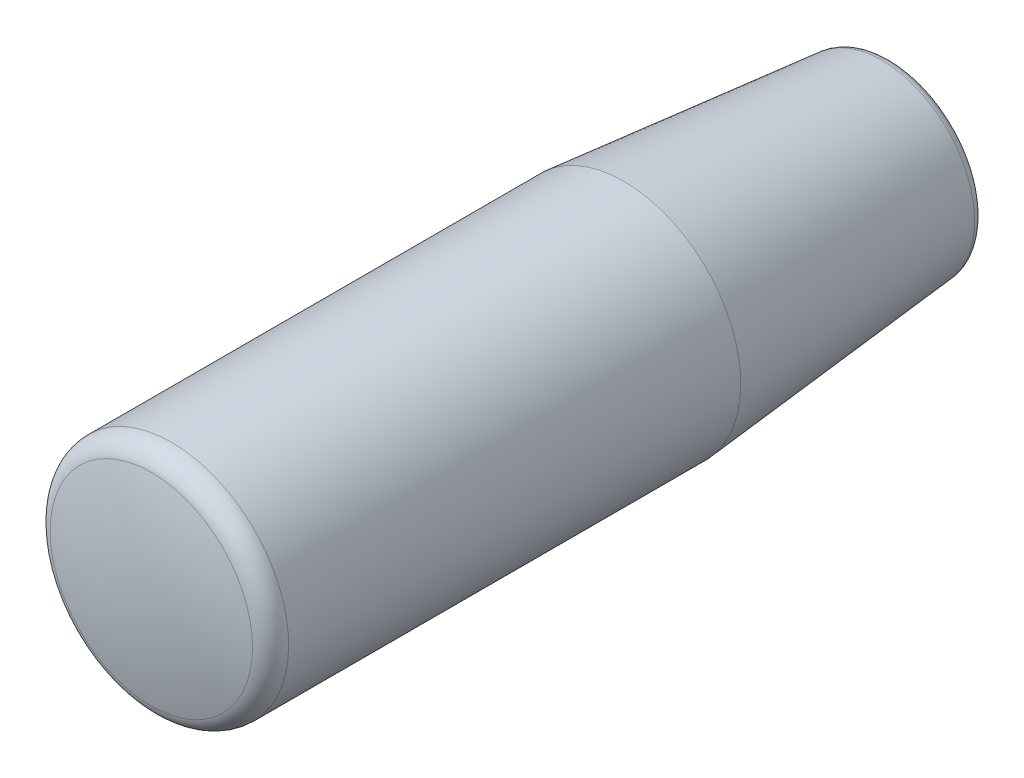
ISO-10303-21;
HEADER;
FILE_DESCRIPTION(('STEP AP214'),'2;1');
FILE_NAME('part.step','',(''),(''),'','','');
FILE_SCHEMA(('AUTOMOTIVE_DESIGN { 1 0 10303 214 1 1 1 1 }'));
ENDSEC;
DATA;
#1=APPLICATION_CONTEXT('core data for automotive mechanical design processes');
#2=APPLICATION_PROTOCOL_DEFINITION('international standard','automotive_design',2000,#1);
#3=PRODUCT_CONTEXT('',#1,'mechanical');
#4=PRODUCT('Part','Part','',(#3));
#5=PRODUCT_RELATED_PRODUCT_CATEGORY('part','',(#4));
#6=PRODUCT_DEFINITION_FORMATION('','',#4);
#7=PRODUCT_DEFINITION_CONTEXT('part definition',#1,'design');
#8=PRODUCT_DEFINITION('design','',#6,#7);
#9=PRODUCT_DEFINITION_SHAPE('','',#8);
#10=(LENGTH_UNIT() NAMED_UNIT(*) SI_UNIT(.MILLI.,.METRE.));
#11=(NAMED_UNIT(*) PLANE_ANGLE_UNIT() SI_UNIT($,.RADIAN.));
#12=(NAMED_UNIT(*) SI_UNIT($,.STERADIAN.) SOLID_ANGLE_UNIT());
#13=UNCERTAINTY_MEASURE_WITH_UNIT(LENGTH_MEASURE(1.E-05),#10,'distance_accuracy_value','');
#14=(GEOMETRIC_REPRESENTATION_CONTEXT(3) GLOBAL_UNCERTAINTY_ASSIGNED_CONTEXT((#13)) GLOBAL_UNIT_ASSIGNED_CONTEXT((#10,
#11,#12)) REPRESENTATION_CONTEXT('',''));
#15=CARTESIAN_POINT('',(0.,0.,0.));
#16=DIRECTION('',(0.,0.,1.));
#17=DIRECTION('',(1.,0.,0.));
#18=AXIS2_PLACEMENT_3D('',#15,#16,#17);
#19=CARTESIAN_POINT('',(0.,0.,0.));
#20=DIRECTION('',(0.,0.,-1.));
#21=DIRECTION('',(0.,1.,0.));
#22=AXIS2_PLACEMENT_3D('',#19,#20,#21);
#23=PLANE('',#22);
#24=CARTESIAN_POINT('',(0.,0.,0.));
#25=DIRECTION('',(0.,0.,-1.));
#26=DIRECTION('',(0.,1.,0.));
#27=AXIS2_PLACEMENT_3D('',#24,#25,#26);
#28=CIRCLE('',#27,5.25);
#29=CARTESIAN_POINT('',(0.,5.25,0.));
#30=VERTEX_POINT('',#29);
#31=EDGE_CURVE('E43',#30,#30,#28,.T.);
#32=ORIENTED_EDGE('',*,*,#31,.F.);
#33=EDGE_LOOP('',(#32));
#34=FACE_BOUND('',#33,.T.);
#35=CARTESIAN_POINT('',(0.,0.,0.));
#36=DIRECTION('',(0.,0.,-1.));
#37=DIRECTION('',(0.,1.,0.));
#38=AXIS2_PLACEMENT_3D('',#35,#36,#37);
#39=CIRCLE('',#38,9.86170635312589);
#40=CARTESIAN_POINT('',(0.,9.86170635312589,0.));
#41=VERTEX_POINT('',#40);
#42=EDGE_CURVE('E8',#41,#41,#39,.T.);
#43=ORIENTED_EDGE('',*,*,#42,.T.);
#44=EDGE_LOOP('',(#43));
#45=FACE_BOUND('',#44,.T.);
#46=ADVANCED_FACE('F12',(#34,#45),#23,.T.);
#47=CARTESIAN_POINT('',(0.,0.,1.25));
#48=DIRECTION('',(0.,0.,-1.));
#49=DIRECTION('',(0.,1.,0.));
#50=AXIS2_PLACEMENT_3D('',#47,#48,#49);
#51=TOROIDAL_SURFACE('',#50,9.86170635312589,1.25);
#52=CARTESIAN_POINT('',(0.,0.,1.13332411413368));
#53=DIRECTION('',(0.,0.,-1.));
#54=DIRECTION('',(0.,1.,0.));
#55=AXIS2_PLACEMENT_3D('',#52,#53,#54);
#56=CIRCLE('',#55,11.1062491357);
#57=CARTESIAN_POINT('',(0.,11.1062491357,1.13332411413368));
#58=VERTEX_POINT('',#57);
#59=EDGE_CURVE('E18',#58,#58,#56,.T.);
#60=ORIENTED_EDGE('',*,*,#59,.T.);
#61=EDGE_LOOP('',(#60));
#62=FACE_BOUND('',#61,.T.);
#63=ORIENTED_EDGE('',*,*,#42,.F.);
#64=EDGE_LOOP('',(#63));
#65=FACE_BOUND('',#64,.T.);
#66=ADVANCED_FACE('F50',(#62,#65),#51,.T.);
#67=CARTESIAN_POINT('',(0.,0.,1.13332411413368));
#68=DIRECTION('',(0.,0.,1.));
#69=DIRECTION('',(0.,-1.,0.));
#70=AXIS2_PLACEMENT_3D('',#67,#68,#69);
#71=CONICAL_SURFACE('',#70,11.1062491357,0.0934767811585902);
#72=CARTESIAN_POINT('',(0.,0.,32.));
#73=DIRECTION('',(0.,0.,-1.));
#74=DIRECTION('',(0.,1.,0.));
#75=AXIS2_PLACEMENT_3D('',#72,#73,#74);
#76=CIRCLE('',#75,14.);
#77=CARTESIAN_POINT('',(0.,14.,32.));
#78=VERTEX_POINT('',#77);
#79=EDGE_CURVE('E22',#78,#78,#76,.T.);
#80=ORIENTED_EDGE('',*,*,#79,.T.);
#81=EDGE_LOOP('',(#80));
#82=FACE_BOUND('',#81,.T.);
#83=ORIENTED_EDGE('',*,*,#59,.F.);
#84=EDGE_LOOP('',(#83));
#85=FACE_BOUND('',#84,.T.);
#86=ADVANCED_FACE('F56',(#82,#85),#71,.T.);
#87=CARTESIAN_POINT('',(0.,0.,0.));
#88=DIRECTION('',(0.,0.,-1.));
#89=DIRECTION('',(0.,1.,0.));
#90=AXIS2_PLACEMENT_3D('',#87,#88,#89);
#91=CYLINDRICAL_SURFACE('',#90,14.);
#92=CARTESIAN_POINT('',(0.,0.,86.0868744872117));
#93=DIRECTION('',(0.,0.,-1.));
#94=DIRECTION('',(0.,1.,0.));
#95=AXIS2_PLACEMENT_3D('',#92,#93,#94);
#96=CIRCLE('',#95,14.);
#97=CARTESIAN_POINT('',(0.,14.,86.0868744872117));
#98=VERTEX_POINT('',#97);
#99=EDGE_CURVE('E26',#98,#98,#96,.T.);
#100=ORIENTED_EDGE('',*,*,#99,.T.);
#101=EDGE_LOOP('',(#100));
#102=FACE_BOUND('',#101,.T.);
#103=ORIENTED_EDGE('',*,*,#79,.F.);
#104=EDGE_LOOP('',(#103));
#105=FACE_BOUND('',#104,.T.);
#106=ADVANCED_FACE('F61',(#102,#105),#91,.T.);
#107=CARTESIAN_POINT('',(0.,0.,86.0868744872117));
#108=DIRECTION('',(0.,0.,-1.));
#109=DIRECTION('',(0.,1.,0.));
#110=AXIS2_PLACEMENT_3D('',#107,#108,#109);
#111=TOROIDAL_SURFACE('',#110,11.5,2.5);
#112=CARTESIAN_POINT('',(0.,0.,88.5124994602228));
#113=DIRECTION('',(0.,0.,-1.));
#114=DIRECTION('',(0.,1.,0.));
#115=AXIS2_PLACEMENT_3D('',#112,#113,#114);
#116=CIRCLE('',#115,12.1052631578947);
#117=CARTESIAN_POINT('',(0.,12.1052631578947,88.5124994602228));
#118=VERTEX_POINT('',#117);
#119=EDGE_CURVE('E31',#118,#118,#116,.T.);
#120=ORIENTED_EDGE('',*,*,#119,.T.);
#121=EDGE_LOOP('',(#120));
#122=FACE_BOUND('',#121,.T.);
#123=ORIENTED_EDGE('',*,*,#99,.F.);
#124=EDGE_LOOP('',(#123));
#125=FACE_BOUND('',#124,.T.);
#126=ADVANCED_FACE('F68',(#122,#125),#111,.T.);
#127=CARTESIAN_POINT('',(0.,0.,40.));
#128=DIRECTION('',(0.,0.,-1.));
#129=DIRECTION('',(1.,0.,0.));
#130=AXIS2_PLACEMENT_3D('',#127,#128,#129);
#131=SPHERICAL_SURFACE('',#130,50.);
#132=ORIENTED_EDGE('',*,*,#119,.F.);
#133=EDGE_LOOP('',(#132));
#134=FACE_BOUND('',#133,.T.);
#135=ADVANCED_FACE('F72',(#134),#131,.T.);
#136=CARTESIAN_POINT('',(0.,5.,55.));
#137=DIRECTION('',(0.,0.,1.));
#138=DIRECTION('',(0.,-1.,0.));
#139=AXIS2_PLACEMENT_3D('',#136,#137,#138);
#140=PLANE('',#139);
#141=CARTESIAN_POINT('',(0.,0.,55.));
#142=DIRECTION('',(0.,0.,-1.));
#143=DIRECTION('',(0.,1.,0.));
#144=AXIS2_PLACEMENT_3D('',#141,#142,#143);
#145=CIRCLE('',#144,5.);
#146=CARTESIAN_POINT('',(0.,5.,55.));
#147=VERTEX_POINT('',#146);
#148=EDGE_CURVE('E34',#147,#147,#145,.T.);
#149=ORIENTED_EDGE('',*,*,#148,.T.);
#150=EDGE_LOOP('',(#149));
#151=FACE_BOUND('',#150,.T.);
#152=ADVANCED_FACE('F76',(#151),#140,.F.);
#153=CARTESIAN_POINT('',(0.,0.,0.));
#154=DIRECTION('',(0.,0.,-1.));
#155=DIRECTION('',(0.,1.,0.));
#156=AXIS2_PLACEMENT_3D('',#153,#154,#155);
#157=CYLINDRICAL_SURFACE('',#156,5.);
#158=ORIENTED_EDGE('',*,*,#148,.F.);
#159=EDGE_LOOP('',(#158));
#160=FACE_BOUND('',#159,.T.);
#161=CARTESIAN_POINT('',(0.,0.,7.));
#162=DIRECTION('',(0.,0.,-1.));
#163=DIRECTION('',(0.,1.,0.));
#164=AXIS2_PLACEMENT_3D('',#161,#162,#163);
#165=CIRCLE('',#164,5.);
#166=CARTESIAN_POINT('',(0.,5.,7.));
#167=VERTEX_POINT('',#166);
#168=EDGE_CURVE('E37',#167,#167,#165,.T.);
#169=ORIENTED_EDGE('',*,*,#168,.T.);
#170=EDGE_LOOP('',(#169));
#171=FACE_BOUND('',#170,.T.);
#172=ADVANCED_FACE('F80',(#160,#171),#157,.F.);
#173=CARTESIAN_POINT('',(0.,5.25,7.));
#174=DIRECTION('',(0.,0.,1.));
#175=DIRECTION('',(0.,-1.,0.));
#176=AXIS2_PLACEMENT_3D('',#173,#174,#175);
#177=PLANE('',#176);
#178=ORIENTED_EDGE('',*,*,#168,.F.);
#179=EDGE_LOOP('',(#178));
#180=FACE_BOUND('',#179,.T.);
#181=CARTESIAN_POINT('',(0.,0.,7.));
#182=DIRECTION('',(0.,0.,-1.));
#183=DIRECTION('',(0.,1.,0.));
#184=AXIS2_PLACEMENT_3D('',#181,#182,#183);
#185=CIRCLE('',#184,5.25);
#186=CARTESIAN_POINT('',(0.,5.25,7.));
#187=VERTEX_POINT('',#186);
#188=EDGE_CURVE('E40',#187,#187,#185,.T.);
#189=ORIENTED_EDGE('',*,*,#188,.T.);
#190=EDGE_LOOP('',(#189));
#191=FACE_BOUND('',#190,.T.);
#192=ADVANCED_FACE('F84',(#180,#191),#177,.F.);
#193=CARTESIAN_POINT('',(0.,0.,0.));
#194=DIRECTION('',(0.,0.,-1.));
#195=DIRECTION('',(0.,1.,0.));
#196=AXIS2_PLACEMENT_3D('',#193,#194,#195);
#197=CYLINDRICAL_SURFACE('',#196,5.25);
#198=ORIENTED_EDGE('',*,*,#188,.F.);
#199=EDGE_LOOP('',(#198));
#200=FACE_BOUND('',#199,.T.);
#201=ORIENTED_EDGE('',*,*,#31,.T.);
#202=EDGE_LOOP('',(#201));
#203=FACE_BOUND('',#202,.T.);
#204=ADVANCED_FACE('F47',(#200,#203),#197,.F.);
#205=CLOSED_SHELL('',(#46,#66,#86,#106,#126,#135,#152,#172,#192,#204));
#206=MANIFOLD_SOLID_BREP('B1',#205);
#207=ADVANCED_BREP_SHAPE_REPRESENTATION('',(#18,#206),#14);
#208=SHAPE_DEFINITION_REPRESENTATION(#9,#207);
ENDSEC;
END-ISO-10303-21;
